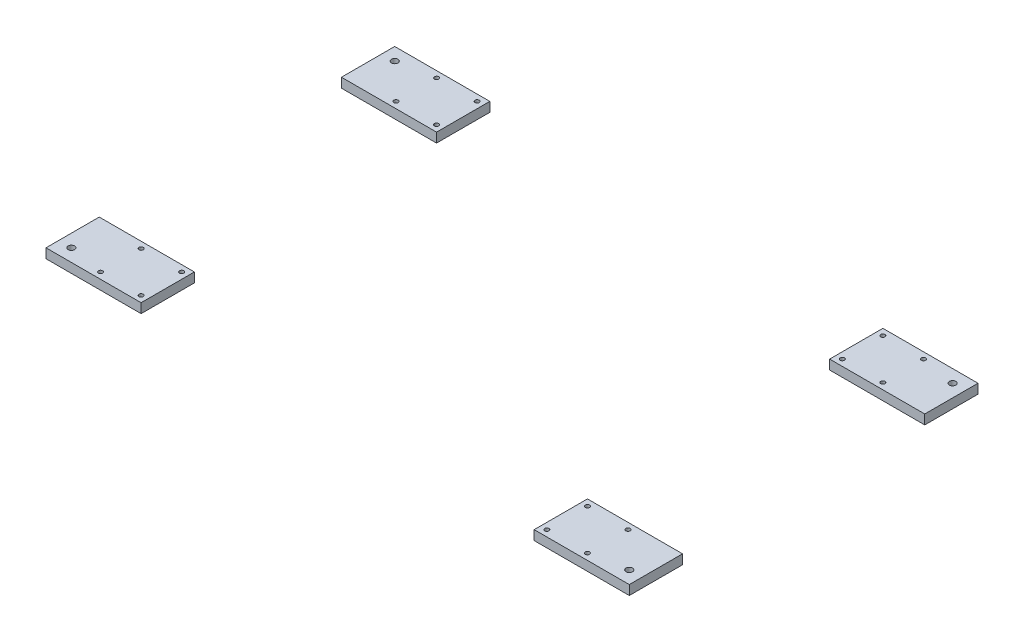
from build123d import *

# Parameters (mm, degrees)
SKETCH_1_W           = 150
SKETCH_1_H           = 15
EXTRUDE_1_DEPTH      = 550
EXTRUDE_1_2_DEPTH    = 550
SKETCH_2_OUTSIDE_W   = 1136.394
SKETCH_2_OUTSIDE_H   = 766.394
SKETCH_2_OUTSIDE_W_2 = 150
SKETCH_2_OUTSIDE_H_2 = 84
SKETCH_2_OUTSIDE_R   = 3.375
SKETCH_2_OUTSIDE_R_2 = 5.125
CUT_EXTRUDE_1_DEPTH  = 550


with BuildPart() as part:
    # Sketch 1 → Extrude 1 (new body)
    with BuildSketch(Plane.XY):
        with Locations((75, 7.5)):
            Rectangle(SKETCH_1_W, SKETCH_1_H)
    extrude(amount=EXTRUDE_1_DEPTH)


with BuildPart() as body_2:
    # Sketch 1 → Extrude 1 2 (new body)
    with BuildSketch(Plane.XY):
        with Locations((845, 7.5)):
            Rectangle(SKETCH_1_W, SKETCH_1_H)
    extrude(amount=EXTRUDE_1_2_DEPTH)


with BuildPart() as cut_extrude_1_tool:
    # Sketch 2 outside → Cut-Extrude 1 (new body)
    # profile 1 of 21: a face of its own
    with BuildSketch(Plane(origin=(0, 15, 0), x_dir=(1, 0, 0), z_dir=(0, 1, 0))):
        with Locations((460, -275)):
            Rectangle(SKETCH_2_OUTSIDE_W, SKETCH_2_OUTSIDE_H)
        with Locations((75, -508)):
            Rectangle(SKETCH_2_OUTSIDE_W_2, SKETCH_2_OUTSIDE_H_2, mode=Mode.SUBTRACT)
        with Locations((75, -42)):
            Rectangle(SKETCH_2_OUTSIDE_W_2, SKETCH_2_OUTSIDE_H_2, mode=Mode.SUBTRACT)
        with Locations((845, -508)):
            Rectangle(SKETCH_2_OUTSIDE_W_2, SKETCH_2_OUTSIDE_H_2, mode=Mode.SUBTRACT)
        with Locations((845, -42)):
            Rectangle(SKETCH_2_OUTSIDE_W_2, SKETCH_2_OUTSIDE_H_2, mode=Mode.SUBTRACT)
    # profile 2 of 21: a face of its own
    with BuildSketch(Plane(origin=(0, 15, 0), x_dir=(1, 0, 0), z_dir=(0, 1, 0))):
        with Locations(Location((140, -540, 0), (0, 0, 270))):
            Circle(SKETCH_2_OUTSIDE_R)
    # profile 3 of 21: a face of its own
    with BuildSketch(Plane(origin=(0, 15, 0), x_dir=(1, 0, 0), z_dir=(0, 1, 0))):
        with Locations(Location((140, -476, 0), (0, 0, 270))):
            Circle(SKETCH_2_OUTSIDE_R)
    # profile 4 of 21: a face of its own
    with BuildSketch(Plane(origin=(0, 15, 0), x_dir=(1, 0, 0), z_dir=(0, 1, 0))):
        with Locations(Location((76, -476, 0), (0, 0, 270))):
            Circle(SKETCH_2_OUTSIDE_R)
    # profile 5 of 21: a face of its own
    with BuildSketch(Plane(origin=(0, 15, 0), x_dir=(1, 0, 0), z_dir=(0, 1, 0))):
        with Locations(Location((76, -540, 0), (0, 0, 270))):
            Circle(SKETCH_2_OUTSIDE_R)
    # profile 6 of 21: a face of its own
    with BuildSketch(Plane(origin=(0, 15, 0), x_dir=(1, 0, 0), z_dir=(0, 1, 0))):
        with Locations(Location((20, -530, 0), (0, 0, 270))):
            Circle(SKETCH_2_OUTSIDE_R_2)
    # profile 7 of 21: a face of its own
    with BuildSketch(Plane(origin=(0, 15, 0), x_dir=(1, 0, 0), z_dir=(0, 1, 0))):
        with Locations(Location((140, -10, 0), (0, 0, 270))):
            Circle(SKETCH_2_OUTSIDE_R)
    # profile 8 of 21: a face of its own
    with BuildSketch(Plane(origin=(0, 15, 0), x_dir=(1, 0, 0), z_dir=(0, 1, 0))):
        with Locations(Location((140, -74, 0), (0, 0, 270))):
            Circle(SKETCH_2_OUTSIDE_R)
    # profile 9 of 21: a face of its own
    with BuildSketch(Plane(origin=(0, 15, 0), x_dir=(1, 0, 0), z_dir=(0, 1, 0))):
        with Locations(Location((76, -74, 0), (0, 0, 270))):
            Circle(SKETCH_2_OUTSIDE_R)
    # profile 10 of 21: a face of its own
    with BuildSketch(Plane(origin=(0, 15, 0), x_dir=(1, 0, 0), z_dir=(0, 1, 0))):
        with Locations(Location((76, -10, 0), (0, 0, 270))):
            Circle(SKETCH_2_OUTSIDE_R)
    # profile 11 of 21: a face of its own
    with BuildSketch(Plane(origin=(0, 15, 0), x_dir=(1, 0, 0), z_dir=(0, 1, 0))):
        with Locations(Location((20, -20, 0), (0, 0, 270))):
            Circle(SKETCH_2_OUTSIDE_R_2)
    # profile 12 of 21: a face of its own
    with BuildSketch(Plane(origin=(0, 15, 0), x_dir=(1, 0, 0), z_dir=(0, 1, 0))):
        with Locations(Location((780, -540, 0), (0, 0, 270))):
            Circle(SKETCH_2_OUTSIDE_R)
    # profile 13 of 21: a face of its own
    with BuildSketch(Plane(origin=(0, 15, 0), x_dir=(1, 0, 0), z_dir=(0, 1, 0))):
        with Locations(Location((780, -476, 0), (0, 0, 270))):
            Circle(SKETCH_2_OUTSIDE_R)
    # profile 14 of 21: a face of its own
    with BuildSketch(Plane(origin=(0, 15, 0), x_dir=(1, 0, 0), z_dir=(0, 1, 0))):
        with Locations(Location((844, -476, 0), (0, 0, 270))):
            Circle(SKETCH_2_OUTSIDE_R)
    # profile 15 of 21: a face of its own
    with BuildSketch(Plane(origin=(0, 15, 0), x_dir=(1, 0, 0), z_dir=(0, 1, 0))):
        with Locations(Location((844, -540, 0), (0, 0, 270))):
            Circle(SKETCH_2_OUTSIDE_R)
    # profile 16 of 21: a face of its own
    with BuildSketch(Plane(origin=(0, 15, 0), x_dir=(1, 0, 0), z_dir=(0, 1, 0))):
        with Locations(Location((900, -530, 0), (0, 0, 270))):
            Circle(SKETCH_2_OUTSIDE_R_2)
    # profile 17 of 21: a face of its own
    with BuildSketch(Plane(origin=(0, 15, 0), x_dir=(1, 0, 0), z_dir=(0, 1, 0))):
        with Locations(Location((780, -10, 0), (0, 0, 270))):
            Circle(SKETCH_2_OUTSIDE_R)
    # profile 18 of 21: a face of its own
    with BuildSketch(Plane(origin=(0, 15, 0), x_dir=(1, 0, 0), z_dir=(0, 1, 0))):
        with Locations(Location((780, -74, 0), (0, 0, 270))):
            Circle(SKETCH_2_OUTSIDE_R)
    # profile 19 of 21: a face of its own
    with BuildSketch(Plane(origin=(0, 15, 0), x_dir=(1, 0, 0), z_dir=(0, 1, 0))):
        with Locations(Location((844, -74, 0), (0, 0, 270))):
            Circle(SKETCH_2_OUTSIDE_R)
    # profile 20 of 21: a face of its own
    with BuildSketch(Plane(origin=(0, 15, 0), x_dir=(1, 0, 0), z_dir=(0, 1, 0))):
        with Locations(Location((844, -10, 0), (0, 0, 270))):
            Circle(SKETCH_2_OUTSIDE_R)
    # profile 21 of 21: a face of its own
    with BuildSketch(Plane(origin=(0, 15, 0), x_dir=(1, 0, 0), z_dir=(0, 1, 0))):
        with Locations(Location((900, -20, 0), (0, 0, 270))):
            Circle(SKETCH_2_OUTSIDE_R_2)
    extrude(amount=-CUT_EXTRUDE_1_DEPTH)


with BuildPart() as part_1:
    add(part.part)

    # Cut-Extrude 1: cut by cut_extrude_1_tool
    add(cut_extrude_1_tool.part, mode=Mode.SUBTRACT)


with BuildPart() as body_2_1:
    add(body_2.part)

    # Cut-Extrude 1: cut by cut_extrude_1_tool
    add(cut_extrude_1_tool.part, mode=Mode.SUBTRACT)


with BuildPart() as cut_extrude_1_piece_1:
    # of the separate pieces the step leaves, piece 1, a body of its own (cut_extrude_1_pieces)
    add(part_1.part.solids().sort_by_distance((0, 15, 466))[0])


with BuildPart() as cut_extrude_1_piece_2:
    # of the separate pieces the step leaves, piece 2, a body of its own (cut_extrude_1_pieces)
    add(part_1.part.solids().sort_by_distance((150, 15, 0))[0])


with BuildPart() as cut_extrude_1_piece_1_of_body_2:
    # of the separate pieces the step leaves, piece 1, a body of its own (cut_extrude_1_pieces_of_body_2)
    add(body_2_1.part.solids().sort_by_distance((770, 15, 0))[0])


with BuildPart() as cut_extrude_1_piece_2_of_body_2:
    # of the separate pieces the step leaves, piece 2, a body of its own (cut_extrude_1_pieces_of_body_2)
    add(body_2_1.part.solids().sort_by_distance((920, 15, 466))[0])


solid = Compound([cut_extrude_1_piece_1.part, cut_extrude_1_piece_2.part, cut_extrude_1_piece_1_of_body_2.part, cut_extrude_1_piece_2_of_body_2.part])
